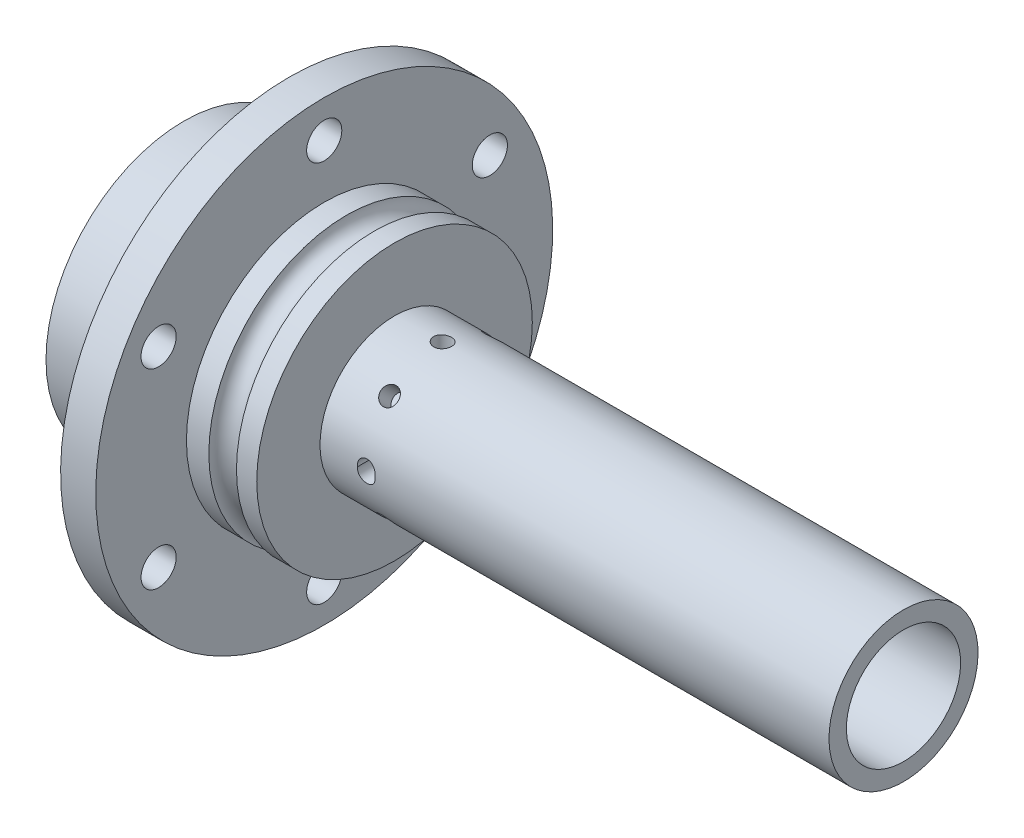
from build123d import *

# Parameters (mm, degrees)
SKETCH6_R           = 13.462
BOSS_EXTRUDE2_DEPTH = 91.948
SKETCH7_R           = 10.31875
CUT_EXTRUDE3_DEPTH  = 143.667195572
SKETCH8_R           = 12.7
CUT_EXTRUDE4_DEPTH  = 19.05
SKETCH10_R          = 1.5875
CUT_EXTRUDE5_DEPTH  = 143.373128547
CIRPATTERN1_COUNT   = 6
CIRPATTERN1_ANGLE   = 225
SKETCH12_R          = 2.032
CUT_EXTRUDE7_DEPTH  = 6.35
CIRPATTERN3_COUNT   = 6
SKETCH13_R          = 3.175
CUT_EXTRUDE8_DEPTH  = 126.578663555
CIRPATTERN4_COUNT   = 6


with BuildPart() as part:
    # Sketch1 → Revolve1 (revolve)
    with BuildSketch(Plane.XY):
        with BuildLine():
            Line((-0.32274613, 0.508), (-0.32274613, 25.4))
            Line((-0.32274613, 25.4), (18.696498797, 25.4))
            Line((18.696498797, 25.4), (18.696498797, 41.783))
            Line((18.696498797, 41.783), (25.046498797, 41.783))
            Line((25.046498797, 41.783), (25.046498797, 25.4))
            Line((25.046498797, 25.4), (29.089472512, 25.4))
            ThreePointArc((29.089472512, 25.4), (31.585483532, 23.005204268), (34.081494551, 25.4))
            Line((34.081494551, 25.4), (37.746498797, 25.4))
            Line((37.746498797, 25.4), (37.746498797, 0.508))
            Line((37.746498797, 0.508), (-0.32274613, 0.508))
        make_face()
    revolve(axis=Axis((37.746498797, 0.508, 0), (-1, 0, 0)))

    # Sketch6 → Boss-Extrude2 (add)
    with BuildSketch(Plane(origin=(37.746498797, 0, 0), x_dir=(0, 0, -1), z_dir=(1, 0, 0))):
        with Locations(Location((0, 0.508, 0), (0, 0, 90))):
            Circle(SKETCH6_R)
    extrude(amount=BOSS_EXTRUDE2_DEPTH)

    # Sketch7 → Cut-Extrude3 (cut, through all)
    with BuildSketch(Plane(origin=(129.694498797, 0, 0), x_dir=(0, 0, -1), z_dir=(1, 0, 0))):
        with Locations(Location((0, 0.508, 0), (0, 0, 90))):
            Circle(SKETCH7_R)
    extrude(amount=-CUT_EXTRUDE3_DEPTH, mode=Mode.SUBTRACT)

    # Sketch8 → Cut-Extrude4 (cut)
    with BuildSketch(Plane.ZY.offset(0.32274613)):
        with Locations(Location((0, 0.508, 0), (0, 0, 270))):
            Circle(SKETCH8_R)
    extrude(amount=-CUT_EXTRUDE4_DEPTH, mode=Mode.SUBTRACT)

    # Sketch10 → Cut-Extrude5 (cut, symmetric)
    with BuildSketch(Plane.XY):
        with Locations((46.107860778, 0.180599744)):
            Circle(SKETCH10_R)
    cut_extrude5 = extrude(amount=CUT_EXTRUDE5_DEPTH, both=True, mode=Mode.SUBTRACT)

    # CirPattern1: Cut-Extrude5 ×6 about axis
    cirpattern1_axis = Axis((129.694498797, 0.508, 0), (1, 0, 0))
    for i in range(1, CIRPATTERN1_COUNT):
        add(cut_extrude5.rotate(cirpattern1_axis, i * CIRPATTERN1_ANGLE / (CIRPATTERN1_COUNT - 1)), mode=Mode.SUBTRACT)

    # Sketch12 → Cut-Extrude7 (cut)
    with BuildSketch(Plane.ZY.offset(0.32274613)):
        with Locations(Location((0, 19.05, 0), (0, 0, 270))):
            Circle(SKETCH12_R)
    cut_extrude7 = extrude(amount=-CUT_EXTRUDE7_DEPTH, mode=Mode.SUBTRACT)

    # CirPattern3: Cut-Extrude7 ×6 about axis
    cirpattern3_axis = Axis((0, 0.508, 0), (1, 0, 0))
    for i in range(1, CIRPATTERN3_COUNT):
        add(cut_extrude7.rotate(cirpattern3_axis, i * 360 / CIRPATTERN3_COUNT), mode=Mode.SUBTRACT)

    # Sketch13 → Cut-Extrude8 (cut, symmetric)
    with BuildSketch(Plane.ZY.offset(-18.696498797)):
        with Locations(Location((0, 35.052, 0), (0, 0, 270))):
            Circle(SKETCH13_R)
    cut_extrude8 = extrude(amount=CUT_EXTRUDE8_DEPTH, both=True, mode=Mode.SUBTRACT)

    # CirPattern4: Cut-Extrude8 ×6 about axis
    cirpattern4_axis = Axis((0, 0.508, 0), (1, 0, 0))
    for i in range(1, CIRPATTERN4_COUNT):
        add(cut_extrude8.rotate(cirpattern4_axis, i * 360 / CIRPATTERN4_COUNT), mode=Mode.SUBTRACT)


solid = part.part
